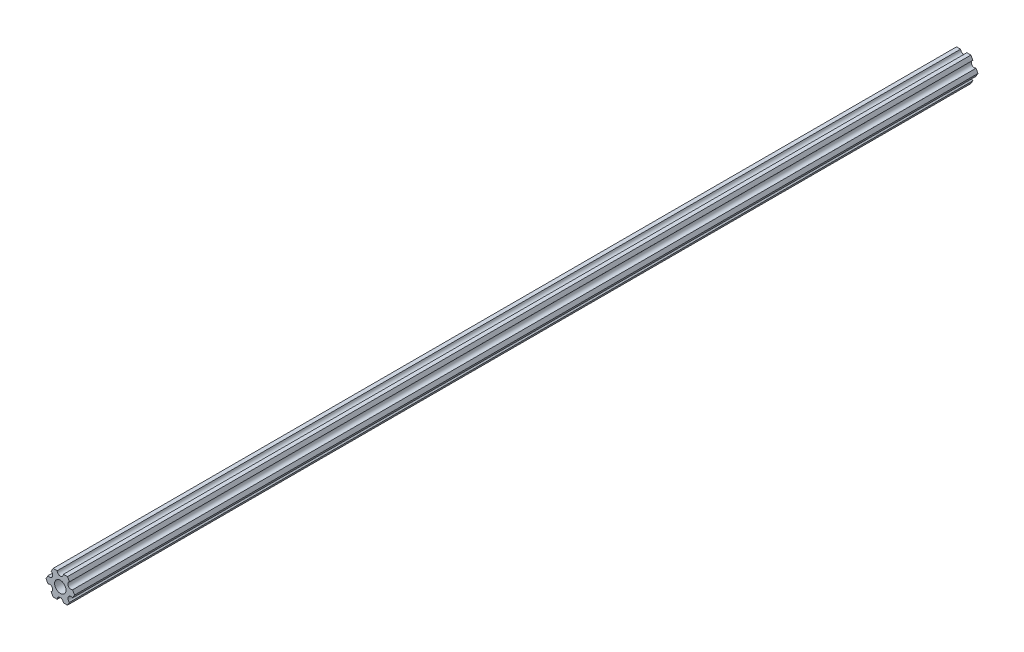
ISO-10303-21;
HEADER;
FILE_DESCRIPTION(('STEP AP214'),'2;1');
FILE_NAME('part.step','',(''),(''),'','','');
FILE_SCHEMA(('AUTOMOTIVE_DESIGN { 1 0 10303 214 1 1 1 1 }'));
ENDSEC;
DATA;
#1=APPLICATION_CONTEXT('core data for automotive mechanical design processes');
#2=APPLICATION_PROTOCOL_DEFINITION('international standard','automotive_design',2000,#1);
#3=PRODUCT_CONTEXT('',#1,'mechanical');
#4=PRODUCT('Part','Part','',(#3));
#5=PRODUCT_RELATED_PRODUCT_CATEGORY('part','',(#4));
#6=PRODUCT_DEFINITION_FORMATION('','',#4);
#7=PRODUCT_DEFINITION_CONTEXT('part definition',#1,'design');
#8=PRODUCT_DEFINITION('design','',#6,#7);
#9=PRODUCT_DEFINITION_SHAPE('','',#8);
#10=(LENGTH_UNIT() NAMED_UNIT(*) SI_UNIT(.MILLI.,.METRE.));
#11=(NAMED_UNIT(*) PLANE_ANGLE_UNIT() SI_UNIT($,.RADIAN.));
#12=(NAMED_UNIT(*) SI_UNIT($,.STERADIAN.) SOLID_ANGLE_UNIT());
#13=UNCERTAINTY_MEASURE_WITH_UNIT(LENGTH_MEASURE(1.E-05),#10,'distance_accuracy_value','');
#14=(GEOMETRIC_REPRESENTATION_CONTEXT(3) GLOBAL_UNCERTAINTY_ASSIGNED_CONTEXT((#13)) GLOBAL_UNIT_ASSIGNED_CONTEXT((#10,
#11,#12)) REPRESENTATION_CONTEXT('',''));
#15=CARTESIAN_POINT('',(0.,0.,0.));
#16=DIRECTION('',(0.,0.,1.));
#17=DIRECTION('',(1.,0.,0.));
#18=AXIS2_PLACEMENT_3D('',#15,#16,#17);
#19=CARTESIAN_POINT('',(3.66617459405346,-6.34999977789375,304.8));
#20=DIRECTION('',(-0.86602543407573,0.499999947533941,0.));
#21=DIRECTION('',(0.,0.,1.));
#22=AXIS2_PLACEMENT_3D('',#19,#20,#21);
#23=PLANE('',#22);
#24=DIRECTION('',(0.499999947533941,0.86602543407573,0.));
#25=VECTOR('',#24,1.);
#26=CARTESIAN_POINT('',(3.66617459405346,-6.34999977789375,0.));
#27=LINE('',#26,#25);
#28=CARTESIAN_POINT('',(3.66617459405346,-6.34999977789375,0.));
#29=VERTEX_POINT('',#28);
#30=CARTESIAN_POINT('',(4.70551158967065,-4.54981504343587,0.));
#31=VERTEX_POINT('',#30);
#32=EDGE_CURVE('E324',#29,#31,#27,.T.);
#33=ORIENTED_EDGE('',*,*,#32,.T.);
#34=DIRECTION('',(0.,0.,-1.));
#35=VECTOR('',#34,1.);
#36=CARTESIAN_POINT('',(4.70551158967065,-4.54981504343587,304.8));
#37=LINE('',#36,#35);
#38=CARTESIAN_POINT('',(4.70551158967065,-4.54981504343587,463.55));
#39=VERTEX_POINT('',#38);
#40=EDGE_CURVE('E12',#39,#31,#37,.T.);
#41=ORIENTED_EDGE('',*,*,#40,.F.);
#42=DIRECTION('',(0.499999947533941,0.86602543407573,0.));
#43=VECTOR('',#42,1.);
#44=CARTESIAN_POINT('',(3.66617459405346,-6.34999977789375,463.55));
#45=LINE('',#44,#43);
#46=CARTESIAN_POINT('',(3.66617459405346,-6.34999977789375,463.55));
#47=VERTEX_POINT('',#46);
#48=EDGE_CURVE('E322',#47,#39,#45,.T.);
#49=ORIENTED_EDGE('',*,*,#48,.F.);
#50=DIRECTION('',(0.,0.,-1.));
#51=VECTOR('',#50,1.);
#52=CARTESIAN_POINT('',(3.66617459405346,-6.34999977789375,304.8));
#53=LINE('',#52,#51);
#54=EDGE_CURVE('E113',#47,#29,#53,.T.);
#55=ORIENTED_EDGE('',*,*,#54,.T.);
#56=EDGE_LOOP('',(#33,#41,#49,#55));
#57=FACE_BOUND('',#56,.T.);
#58=ADVANCED_FACE('F102',(#57),#23,.F.);
#59=CARTESIAN_POINT('',(1.58750038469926,-6.34999990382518,304.8));
#60=DIRECTION('',(-6.05825721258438E-08,1.,0.));
#61=DIRECTION('',(0.,0.,1.));
#62=AXIS2_PLACEMENT_3D('',#59,#60,#61);
#63=PLANE('',#62);
#64=DIRECTION('',(1.,6.05825721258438E-08,0.));
#65=VECTOR('',#64,1.);
#66=CARTESIAN_POINT('',(1.58750038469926,-6.34999990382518,0.));
#67=LINE('',#66,#65);
#68=CARTESIAN_POINT('',(1.58750038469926,-6.34999990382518,0.));
#69=VERTEX_POINT('',#68);
#70=EDGE_CURVE('E387',#69,#29,#67,.T.);
#71=ORIENTED_EDGE('',*,*,#70,.T.);
#72=ORIENTED_EDGE('',*,*,#54,.F.);
#73=DIRECTION('',(0.999999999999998,6.05825721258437E-08,0.));
#74=VECTOR('',#73,1.);
#75=CARTESIAN_POINT('',(1.58750038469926,-6.34999990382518,463.55));
#76=LINE('',#75,#74);
#77=CARTESIAN_POINT('',(1.58750038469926,-6.34999990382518,463.55));
#78=VERTEX_POINT('',#77);
#79=EDGE_CURVE('E339',#78,#47,#76,.T.);
#80=ORIENTED_EDGE('',*,*,#79,.F.);
#81=DIRECTION('',(0.,0.,-1.));
#82=VECTOR('',#81,1.);
#83=CARTESIAN_POINT('',(1.58750038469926,-6.34999990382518,304.8));
#84=LINE('',#83,#82);
#85=EDGE_CURVE('E410',#78,#69,#84,.T.);
#86=ORIENTED_EDGE('',*,*,#85,.T.);
#87=EDGE_LOOP('',(#71,#72,#80,#86));
#88=FACE_BOUND('',#87,.T.);
#89=ADVANCED_FACE('F550',(#88),#63,.F.);
#90=CARTESIAN_POINT('',(3.8469926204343E-07,-6.35,304.8));
#91=DIRECTION('',(0.,0.,-1.));
#92=DIRECTION('',(-1.,0.,0.));
#93=AXIS2_PLACEMENT_3D('',#90,#91,#92);
#94=CYLINDRICAL_SURFACE('',#93,1.5875);
#95=CARTESIAN_POINT('',(3.8469926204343E-07,-6.35,0.));
#96=DIRECTION('',(0.,0.,-1.));
#97=DIRECTION('',(1.,0.,0.));
#98=AXIS2_PLACEMENT_3D('',#95,#96,#97);
#99=CIRCLE('',#98,1.5875);
#100=CARTESIAN_POINT('',(-1.58749961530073,-6.35000009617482,0.));
#101=VERTEX_POINT('',#100);
#102=EDGE_CURVE('E391',#101,#69,#99,.T.);
#103=ORIENTED_EDGE('',*,*,#102,.T.);
#104=ORIENTED_EDGE('',*,*,#85,.F.);
#105=CARTESIAN_POINT('',(3.8469926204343E-07,-6.35,463.55));
#106=DIRECTION('',(0.,0.,1.));
#107=DIRECTION('',(1.,0.,0.));
#108=AXIS2_PLACEMENT_3D('',#105,#106,#107);
#109=CIRCLE('',#108,1.5875);
#110=CARTESIAN_POINT('',(-1.58749961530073,-6.35000009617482,463.55));
#111=VERTEX_POINT('',#110);
#112=EDGE_CURVE('E341',#78,#111,#109,.T.);
#113=ORIENTED_EDGE('',*,*,#112,.T.);
#114=DIRECTION('',(0.,0.,-1.));
#115=VECTOR('',#114,1.);
#116=CARTESIAN_POINT('',(-1.58749961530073,-6.35000009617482,304.8));
#117=LINE('',#116,#115);
#118=EDGE_CURVE('E401',#111,#101,#117,.T.);
#119=ORIENTED_EDGE('',*,*,#118,.T.);
#120=EDGE_LOOP('',(#103,#104,#113,#119));
#121=FACE_BOUND('',#120,.T.);
#122=ADVANCED_FACE('F555',(#121),#94,.F.);
#123=CARTESIAN_POINT('',(-3.66617382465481,-6.35000022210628,304.8));
#124=DIRECTION('',(-6.05825854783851E-08,1.,0.));
#125=DIRECTION('',(0.,0.,1.));
#126=AXIS2_PLACEMENT_3D('',#123,#124,#125);
#127=PLANE('',#126);
#128=DIRECTION('',(1.,6.05825854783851E-08,0.));
#129=VECTOR('',#128,1.);
#130=CARTESIAN_POINT('',(-3.66617382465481,-6.35000022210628,0.));
#131=LINE('',#130,#129);
#132=CARTESIAN_POINT('',(-3.66617382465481,-6.35000022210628,0.));
#133=VERTEX_POINT('',#132);
#134=EDGE_CURVE('E469',#133,#101,#131,.T.);
#135=ORIENTED_EDGE('',*,*,#134,.T.);
#136=ORIENTED_EDGE('',*,*,#118,.F.);
#137=DIRECTION('',(0.999999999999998,6.05825863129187E-08,0.));
#138=VECTOR('',#137,1.);
#139=CARTESIAN_POINT('',(-3.66617382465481,-6.35000022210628,463.55));
#140=LINE('',#139,#138);
#141=CARTESIAN_POINT('',(-3.66617382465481,-6.35000022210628,463.55));
#142=VERTEX_POINT('',#141);
#143=EDGE_CURVE('E347',#142,#111,#140,.T.);
#144=ORIENTED_EDGE('',*,*,#143,.F.);
#145=DIRECTION('',(0.,0.,-1.));
#146=VECTOR('',#145,1.);
#147=CARTESIAN_POINT('',(-3.66617382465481,-6.35000022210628,304.8));
#148=LINE('',#147,#146);
#149=EDGE_CURVE('E398',#142,#133,#148,.T.);
#150=ORIENTED_EDGE('',*,*,#149,.T.);
#151=EDGE_LOOP('',(#135,#136,#144,#150));
#152=FACE_BOUND('',#151,.T.);
#153=ADVANCED_FACE('F596',(#152),#127,.F.);
#154=CARTESIAN_POINT('',(-4.70551103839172,-4.54981561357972,304.8));
#155=DIRECTION('',(0.866025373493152,0.500000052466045,0.));
#156=DIRECTION('',(0.,0.,-1.));
#157=AXIS2_PLACEMENT_3D('',#154,#155,#156);
#158=PLANE('',#157);
#159=DIRECTION('',(0.500000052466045,-0.866025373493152,0.));
#160=VECTOR('',#159,1.);
#161=CARTESIAN_POINT('',(-4.70551103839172,-4.54981561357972,0.));
#162=LINE('',#161,#160);
#163=CARTESIAN_POINT('',(-4.70551103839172,-4.54981561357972,0.));
#164=VERTEX_POINT('',#163);
#165=EDGE_CURVE('E444',#164,#133,#162,.T.);
#166=ORIENTED_EDGE('',*,*,#165,.T.);
#167=ORIENTED_EDGE('',*,*,#149,.F.);
#168=DIRECTION('',(0.500000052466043,-0.866025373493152,0.));
#169=VECTOR('',#168,1.);
#170=CARTESIAN_POINT('',(-4.70551103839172,-4.54981561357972,463.55));
#171=LINE('',#170,#169);
#172=CARTESIAN_POINT('',(-4.70551103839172,-4.54981561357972,463.55));
#173=VERTEX_POINT('',#172);
#174=EDGE_CURVE('E350',#173,#142,#171,.T.);
#175=ORIENTED_EDGE('',*,*,#174,.F.);
#176=DIRECTION('',(0.,0.,-1.));
#177=VECTOR('',#176,1.);
#178=CARTESIAN_POINT('',(-4.70551103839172,-4.54981561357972,304.8));
#179=LINE('',#178,#177);
#180=EDGE_CURVE('E402',#173,#164,#179,.T.);
#181=ORIENTED_EDGE('',*,*,#180,.T.);
#182=EDGE_LOOP('',(#166,#167,#175,#181));
#183=FACE_BOUND('',#182,.T.);
#184=ADVANCED_FACE('F601',(#183),#158,.F.);
#185=CARTESIAN_POINT('',(-5.49926112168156,-3.17500033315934,304.8));
#186=DIRECTION('',(0.,0.,-1.));
#187=DIRECTION('',(-1.,0.,0.));
#188=AXIS2_PLACEMENT_3D('',#185,#186,#187);
#189=CYLINDRICAL_SURFACE('',#188,1.5875);
#190=CARTESIAN_POINT('',(-5.49926112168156,-3.17500033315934,0.));
#191=DIRECTION('',(0.,0.,-1.));
#192=DIRECTION('',(1.,0.,0.));
#193=AXIS2_PLACEMENT_3D('',#190,#191,#192);
#194=CIRCLE('',#193,1.5875);
#195=CARTESIAN_POINT('',(-6.29301120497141,-1.80018505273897,0.));
#196=VERTEX_POINT('',#195);
#197=EDGE_CURVE('E441',#196,#164,#194,.T.);
#198=ORIENTED_EDGE('',*,*,#197,.T.);
#199=ORIENTED_EDGE('',*,*,#180,.F.);
#200=CARTESIAN_POINT('',(-5.49926112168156,-3.17500033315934,463.55));
#201=DIRECTION('',(0.,0.,1.));
#202=DIRECTION('',(1.,0.,0.));
#203=AXIS2_PLACEMENT_3D('',#200,#201,#202);
#204=CIRCLE('',#203,1.5875);
#205=CARTESIAN_POINT('',(-6.29301120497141,-1.80018505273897,463.55));
#206=VERTEX_POINT('',#205);
#207=EDGE_CURVE('E353',#173,#206,#204,.T.);
#208=ORIENTED_EDGE('',*,*,#207,.T.);
#209=DIRECTION('',(0.,0.,-1.));
#210=VECTOR('',#209,1.);
#211=CARTESIAN_POINT('',(-6.29301120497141,-1.80018505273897,304.8));
#212=LINE('',#211,#210);
#213=EDGE_CURVE('E216',#206,#196,#212,.T.);
#214=ORIENTED_EDGE('',*,*,#213,.T.);
#215=EDGE_LOOP('',(#198,#199,#208,#214));
#216=FACE_BOUND('',#215,.T.);
#217=ADVANCED_FACE('F604',(#216),#189,.F.);
#218=CARTESIAN_POINT('',(-7.33234841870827,-4.44212523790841E-07,304.8));
#219=DIRECTION('',(0.866025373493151,0.500000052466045,0.));
#220=DIRECTION('',(0.,0.,-1.));
#221=AXIS2_PLACEMENT_3D('',#218,#219,#220);
#222=PLANE('',#221);
#223=DIRECTION('',(0.500000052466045,-0.866025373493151,0.));
#224=VECTOR('',#223,1.);
#225=CARTESIAN_POINT('',(-7.33234841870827,-4.44212523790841E-07,0.));
#226=LINE('',#225,#224);
#227=CARTESIAN_POINT('',(-7.33234841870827,-4.44212523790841E-07,0.));
#228=VERTEX_POINT('',#227);
#229=EDGE_CURVE('E407',#228,#196,#226,.T.);
#230=ORIENTED_EDGE('',*,*,#229,.T.);
#231=ORIENTED_EDGE('',*,*,#213,.F.);
#232=DIRECTION('',(0.500000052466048,-0.866025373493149,0.));
#233=VECTOR('',#232,1.);
#234=CARTESIAN_POINT('',(-7.33234841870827,-4.44212523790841E-07,463.55));
#235=LINE('',#234,#233);
#236=CARTESIAN_POINT('',(-7.33234841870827,-4.44212523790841E-07,463.55));
#237=VERTEX_POINT('',#236);
#238=EDGE_CURVE('E355',#237,#206,#235,.T.);
#239=ORIENTED_EDGE('',*,*,#238,.F.);
#240=DIRECTION('',(0.,0.,-1.));
#241=VECTOR('',#240,1.);
#242=CARTESIAN_POINT('',(-7.33234841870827,-4.44212523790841E-07,304.8));
#243=LINE('',#242,#241);
#244=EDGE_CURVE('E202',#237,#228,#243,.T.);
#245=ORIENTED_EDGE('',*,*,#244,.T.);
#246=EDGE_LOOP('',(#230,#231,#239,#245));
#247=FACE_BOUND('',#246,.T.);
#248=ADVANCED_FACE('F606',(#247),#222,.F.);
#249=CARTESIAN_POINT('',(-6.29301142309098,1.80018429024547,304.8));
#250=DIRECTION('',(0.866025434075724,-0.499999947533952,0.));
#251=DIRECTION('',(0.,0.,-1.));
#252=AXIS2_PLACEMENT_3D('',#249,#250,#251);
#253=PLANE('',#252);
#254=DIRECTION('',(-0.499999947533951,-0.866025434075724,0.));
#255=VECTOR('',#254,1.);
#256=CARTESIAN_POINT('',(-6.29301142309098,1.80018429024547,0.));
#257=LINE('',#256,#255);
#258=CARTESIAN_POINT('',(-6.29301142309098,1.80018429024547,0.));
#259=VERTEX_POINT('',#258);
#260=EDGE_CURVE('E403',#259,#228,#257,.T.);
#261=ORIENTED_EDGE('',*,*,#260,.T.);
#262=ORIENTED_EDGE('',*,*,#244,.F.);
#263=DIRECTION('',(-0.499999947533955,-0.866025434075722,0.));
#264=VECTOR('',#263,1.);
#265=CARTESIAN_POINT('',(-6.29301142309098,1.80018429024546,463.55));
#266=LINE('',#265,#264);
#267=CARTESIAN_POINT('',(-6.29301142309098,1.80018429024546,463.55));
#268=VERTEX_POINT('',#267);
#269=EDGE_CURVE('E358',#268,#237,#266,.T.);
#270=ORIENTED_EDGE('',*,*,#269,.F.);
#271=DIRECTION('',(0.,0.,-1.));
#272=VECTOR('',#271,1.);
#273=CARTESIAN_POINT('',(-6.29301142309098,1.80018429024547,304.8));
#274=LINE('',#273,#272);
#275=EDGE_CURVE('E397',#268,#259,#274,.T.);
#276=ORIENTED_EDGE('',*,*,#275,.T.);
#277=EDGE_LOOP('',(#261,#262,#270,#276));
#278=FACE_BOUND('',#277,.T.);
#279=ADVANCED_FACE('F611',(#278),#253,.F.);
#280=CARTESIAN_POINT('',(-5.49926150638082,3.17499966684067,304.8));
#281=DIRECTION('',(0.,0.,-1.));
#282=DIRECTION('',(-1.,0.,0.));
#283=AXIS2_PLACEMENT_3D('',#280,#281,#282);
#284=CYLINDRICAL_SURFACE('',#283,1.5875);
#285=CARTESIAN_POINT('',(-5.49926150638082,3.17499966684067,0.));
#286=DIRECTION('',(0.,0.,-1.));
#287=DIRECTION('',(1.,0.,0.));
#288=AXIS2_PLACEMENT_3D('',#285,#286,#287);
#289=CIRCLE('',#288,1.5875);
#290=CARTESIAN_POINT('',(-4.70551158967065,4.54981504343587,0.));
#291=VERTEX_POINT('',#290);
#292=EDGE_CURVE('E406',#291,#259,#289,.T.);
#293=ORIENTED_EDGE('',*,*,#292,.T.);
#294=ORIENTED_EDGE('',*,*,#275,.F.);
#295=CARTESIAN_POINT('',(-5.49926150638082,3.17499966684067,463.55));
#296=DIRECTION('',(0.,0.,1.));
#297=DIRECTION('',(1.,0.,0.));
#298=AXIS2_PLACEMENT_3D('',#295,#296,#297);
#299=CIRCLE('',#298,1.5875);
#300=CARTESIAN_POINT('',(-4.70551158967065,4.54981504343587,463.55));
#301=VERTEX_POINT('',#300);
#302=EDGE_CURVE('E361',#268,#301,#299,.T.);
#303=ORIENTED_EDGE('',*,*,#302,.T.);
#304=DIRECTION('',(0.,0.,-1.));
#305=VECTOR('',#304,1.);
#306=CARTESIAN_POINT('',(-4.70551158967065,4.54981504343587,304.8));
#307=LINE('',#306,#305);
#308=EDGE_CURVE('E424',#301,#291,#307,.T.);
#309=ORIENTED_EDGE('',*,*,#308,.T.);
#310=EDGE_LOOP('',(#293,#294,#303,#309));
#311=FACE_BOUND('',#310,.T.);
#312=ADVANCED_FACE('F104',(#311),#284,.F.);
#313=CARTESIAN_POINT('',(-3.66617459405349,6.3499997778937,304.8));
#314=DIRECTION('',(0.866025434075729,-0.499999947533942,0.));
#315=DIRECTION('',(0.,0.,-1.));
#316=AXIS2_PLACEMENT_3D('',#313,#314,#315);
#317=PLANE('',#316);
#318=DIRECTION('',(-0.499999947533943,-0.866025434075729,0.));
#319=VECTOR('',#318,1.);
#320=CARTESIAN_POINT('',(-3.66617459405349,6.3499997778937,0.));
#321=LINE('',#320,#319);
#322=CARTESIAN_POINT('',(-3.66617459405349,6.3499997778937,0.));
#323=VERTEX_POINT('',#322);
#324=EDGE_CURVE('E416',#323,#291,#321,.T.);
#325=ORIENTED_EDGE('',*,*,#324,.T.);
#326=ORIENTED_EDGE('',*,*,#308,.F.);
#327=DIRECTION('',(-0.499999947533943,-0.866025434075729,0.));
#328=VECTOR('',#327,1.);
#329=CARTESIAN_POINT('',(-3.66617459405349,6.3499997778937,463.55));
#330=LINE('',#329,#328);
#331=CARTESIAN_POINT('',(-3.66617459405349,6.3499997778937,463.55));
#332=VERTEX_POINT('',#331);
#333=EDGE_CURVE('E364',#332,#301,#330,.T.);
#334=ORIENTED_EDGE('',*,*,#333,.F.);
#335=DIRECTION('',(0.,0.,-1.));
#336=VECTOR('',#335,1.);
#337=CARTESIAN_POINT('',(-3.66617459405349,6.3499997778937,304.8));
#338=LINE('',#337,#336);
#339=EDGE_CURVE('E427',#332,#323,#338,.T.);
#340=ORIENTED_EDGE('',*,*,#339,.T.);
#341=EDGE_LOOP('',(#325,#326,#334,#340));
#342=FACE_BOUND('',#341,.T.);
#343=ADVANCED_FACE('F577',(#342),#317,.F.);
#344=CARTESIAN_POINT('',(-1.58750038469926,6.34999990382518,304.8));
#345=DIRECTION('',(6.05825963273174E-08,-1.,0.));
#346=DIRECTION('',(0.,0.,-1.));
#347=AXIS2_PLACEMENT_3D('',#344,#345,#346);
#348=PLANE('',#347);
#349=DIRECTION('',(-1.,-6.05825963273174E-08,0.));
#350=VECTOR('',#349,1.);
#351=CARTESIAN_POINT('',(-1.58750038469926,6.34999990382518,0.));
#352=LINE('',#351,#350);
#353=CARTESIAN_POINT('',(-1.58750038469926,6.34999990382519,0.));
#354=VERTEX_POINT('',#353);
#355=EDGE_CURVE('E420',#354,#323,#352,.T.);
#356=ORIENTED_EDGE('',*,*,#355,.T.);
#357=ORIENTED_EDGE('',*,*,#339,.F.);
#358=DIRECTION('',(-0.999999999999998,-6.05826013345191E-08,0.));
#359=VECTOR('',#358,1.);
#360=CARTESIAN_POINT('',(-1.58750038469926,6.34999990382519,463.55));
#361=LINE('',#360,#359);
#362=CARTESIAN_POINT('',(-1.58750038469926,6.34999990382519,463.55));
#363=VERTEX_POINT('',#362);
#364=EDGE_CURVE('E367',#363,#332,#361,.T.);
#365=ORIENTED_EDGE('',*,*,#364,.F.);
#366=DIRECTION('',(0.,0.,-1.));
#367=VECTOR('',#366,1.);
#368=CARTESIAN_POINT('',(-1.58750038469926,6.34999990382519,304.8));
#369=LINE('',#368,#367);
#370=EDGE_CURVE('E447',#363,#354,#369,.T.);
#371=ORIENTED_EDGE('',*,*,#370,.T.);
#372=EDGE_LOOP('',(#356,#357,#365,#371));
#373=FACE_BOUND('',#372,.T.);
#374=ADVANCED_FACE('F560',(#373),#348,.F.);
#375=CARTESIAN_POINT('',(-3.84699260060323E-07,6.35,304.8));
#376=DIRECTION('',(0.,0.,-1.));
#377=DIRECTION('',(-1.,0.,0.));
#378=AXIS2_PLACEMENT_3D('',#375,#376,#377);
#379=CYLINDRICAL_SURFACE('',#378,1.5875);
#380=CARTESIAN_POINT('',(-3.84699260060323E-07,6.35,0.));
#381=DIRECTION('',(0.,0.,-1.));
#382=DIRECTION('',(1.,0.,0.));
#383=AXIS2_PLACEMENT_3D('',#380,#381,#382);
#384=CIRCLE('',#383,1.5875);
#385=CARTESIAN_POINT('',(1.58749961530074,6.35000009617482,0.));
#386=VERTEX_POINT('',#385);
#387=EDGE_CURVE('E457',#386,#354,#384,.T.);
#388=ORIENTED_EDGE('',*,*,#387,.T.);
#389=ORIENTED_EDGE('',*,*,#370,.F.);
#390=CARTESIAN_POINT('',(-3.84699260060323E-07,6.35,463.55));
#391=DIRECTION('',(0.,0.,1.));
#392=DIRECTION('',(1.,0.,0.));
#393=AXIS2_PLACEMENT_3D('',#390,#391,#392);
#394=CIRCLE('',#393,1.5875);
#395=CARTESIAN_POINT('',(1.58749961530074,6.35000009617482,463.55));
#396=VERTEX_POINT('',#395);
#397=EDGE_CURVE('E370',#363,#396,#394,.T.);
#398=ORIENTED_EDGE('',*,*,#397,.T.);
#399=DIRECTION('',(0.,0.,-1.));
#400=VECTOR('',#399,1.);
#401=CARTESIAN_POINT('',(1.58749961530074,6.35000009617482,304.8));
#402=LINE('',#401,#400);
#403=EDGE_CURVE('E440',#396,#386,#402,.T.);
#404=ORIENTED_EDGE('',*,*,#403,.T.);
#405=EDGE_LOOP('',(#388,#389,#398,#404));
#406=FACE_BOUND('',#405,.T.);
#407=ADVANCED_FACE('F568',(#406),#379,.F.);
#408=CARTESIAN_POINT('',(3.66617382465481,6.35000022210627,304.8));
#409=DIRECTION('',(6.05825850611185E-08,-1.,0.));
#410=DIRECTION('',(0.,0.,-1.));
#411=AXIS2_PLACEMENT_3D('',#408,#409,#410);
#412=PLANE('',#411);
#413=DIRECTION('',(-1.,-6.05825850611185E-08,0.));
#414=VECTOR('',#413,1.);
#415=CARTESIAN_POINT('',(3.66617382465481,6.35000022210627,0.));
#416=LINE('',#415,#414);
#417=CARTESIAN_POINT('',(3.66617382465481,6.35000022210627,0.));
#418=VERTEX_POINT('',#417);
#419=EDGE_CURVE('E461',#418,#386,#416,.T.);
#420=ORIENTED_EDGE('',*,*,#419,.T.);
#421=ORIENTED_EDGE('',*,*,#403,.F.);
#422=DIRECTION('',(-0.999999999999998,-6.05825813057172E-08,0.));
#423=VECTOR('',#422,1.);
#424=CARTESIAN_POINT('',(3.66617382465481,6.35000022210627,463.55));
#425=LINE('',#424,#423);
#426=CARTESIAN_POINT('',(3.66617382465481,6.35000022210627,463.55));
#427=VERTEX_POINT('',#426);
#428=EDGE_CURVE('E373',#427,#396,#425,.T.);
#429=ORIENTED_EDGE('',*,*,#428,.F.);
#430=DIRECTION('',(0.,0.,-1.));
#431=VECTOR('',#430,1.);
#432=CARTESIAN_POINT('',(3.66617382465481,6.35000022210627,304.8));
#433=LINE('',#432,#431);
#434=EDGE_CURVE('E394',#427,#418,#433,.T.);
#435=ORIENTED_EDGE('',*,*,#434,.T.);
#436=EDGE_LOOP('',(#420,#421,#429,#435));
#437=FACE_BOUND('',#436,.T.);
#438=ADVANCED_FACE('F566',(#437),#412,.F.);
#439=CARTESIAN_POINT('',(4.70551103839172,4.54981561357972,304.8));
#440=DIRECTION('',(-0.866025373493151,-0.500000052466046,0.));
#441=DIRECTION('',(-0.500000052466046,0.866025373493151,0.));
#442=AXIS2_PLACEMENT_3D('',#439,#440,#441);
#443=PLANE('',#442);
#444=DIRECTION('',(-0.500000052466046,0.866025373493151,0.));
#445=VECTOR('',#444,1.);
#446=CARTESIAN_POINT('',(4.70551103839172,4.54981561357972,0.));
#447=LINE('',#446,#445);
#448=CARTESIAN_POINT('',(4.70551103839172,4.54981561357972,0.));
#449=VERTEX_POINT('',#448);
#450=EDGE_CURVE('E482',#449,#418,#447,.T.);
#451=ORIENTED_EDGE('',*,*,#450,.T.);
#452=ORIENTED_EDGE('',*,*,#434,.F.);
#453=DIRECTION('',(-0.500000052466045,0.866025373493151,0.));
#454=VECTOR('',#453,1.);
#455=CARTESIAN_POINT('',(4.70551103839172,4.54981561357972,463.55));
#456=LINE('',#455,#454);
#457=CARTESIAN_POINT('',(4.70551103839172,4.54981561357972,463.55));
#458=VERTEX_POINT('',#457);
#459=EDGE_CURVE('E376',#458,#427,#456,.T.);
#460=ORIENTED_EDGE('',*,*,#459,.F.);
#461=DIRECTION('',(0.,0.,-1.));
#462=VECTOR('',#461,1.);
#463=CARTESIAN_POINT('',(4.70551103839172,4.54981561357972,304.8));
#464=LINE('',#463,#462);
#465=EDGE_CURVE('E411',#458,#449,#464,.T.);
#466=ORIENTED_EDGE('',*,*,#465,.T.);
#467=EDGE_LOOP('',(#451,#452,#460,#466));
#468=FACE_BOUND('',#467,.T.);
#469=ADVANCED_FACE('F564',(#468),#443,.F.);
#470=CARTESIAN_POINT('',(7.33234841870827,4.44212519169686E-07,304.8));
#471=DIRECTION('',(-0.866025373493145,-0.500000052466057,0.));
#472=DIRECTION('',(-0.500000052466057,0.866025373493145,0.));
#473=AXIS2_PLACEMENT_3D('',#470,#471,#472);
#474=PLANE('',#473);
#475=DIRECTION('',(-0.500000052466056,0.866025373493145,0.));
#476=VECTOR('',#475,1.);
#477=CARTESIAN_POINT('',(7.33234841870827,4.44212519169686E-07,0.));
#478=LINE('',#477,#476);
#479=CARTESIAN_POINT('',(7.33234841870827,4.44212519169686E-07,0.));
#480=VERTEX_POINT('',#479);
#481=CARTESIAN_POINT('',(6.29301120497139,1.80018505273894,0.));
#482=VERTEX_POINT('',#481);
#483=EDGE_CURVE('E473',#480,#482,#478,.T.);
#484=ORIENTED_EDGE('',*,*,#483,.T.);
#485=DIRECTION('',(0.,0.,-1.));
#486=VECTOR('',#485,1.);
#487=CARTESIAN_POINT('',(6.29301120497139,1.80018505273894,304.8));
#488=LINE('',#487,#486);
#489=CARTESIAN_POINT('',(6.29301120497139,1.80018505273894,463.55));
#490=VERTEX_POINT('',#489);
#491=EDGE_CURVE('E127',#490,#482,#488,.T.);
#492=ORIENTED_EDGE('',*,*,#491,.F.);
#493=DIRECTION('',(-0.500000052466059,0.866025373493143,0.));
#494=VECTOR('',#493,1.);
#495=CARTESIAN_POINT('',(7.33234841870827,4.44212519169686E-07,463.55));
#496=LINE('',#495,#494);
#497=CARTESIAN_POINT('',(7.33234841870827,4.44212519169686E-07,463.55));
#498=VERTEX_POINT('',#497);
#499=EDGE_CURVE('E381',#498,#490,#496,.T.);
#500=ORIENTED_EDGE('',*,*,#499,.F.);
#501=DIRECTION('',(0.,0.,-1.));
#502=VECTOR('',#501,1.);
#503=CARTESIAN_POINT('',(7.33234841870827,4.44212519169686E-07,304.8));
#504=LINE('',#503,#502);
#505=EDGE_CURVE('E171',#498,#480,#504,.T.);
#506=ORIENTED_EDGE('',*,*,#505,.T.);
#507=EDGE_LOOP('',(#484,#492,#500,#506));
#508=FACE_BOUND('',#507,.T.);
#509=ADVANCED_FACE('F546',(#508),#474,.F.);
#510=CARTESIAN_POINT('',(6.29301142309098,-1.80018429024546,304.8));
#511=DIRECTION('',(-0.866025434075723,0.499999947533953,0.));
#512=DIRECTION('',(0.,0.,1.));
#513=AXIS2_PLACEMENT_3D('',#510,#511,#512);
#514=PLANE('',#513);
#515=DIRECTION('',(0.499999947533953,0.866025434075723,0.));
#516=VECTOR('',#515,1.);
#517=CARTESIAN_POINT('',(6.29301142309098,-1.80018429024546,0.));
#518=LINE('',#517,#516);
#519=CARTESIAN_POINT('',(6.29301142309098,-1.80018429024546,0.));
#520=VERTEX_POINT('',#519);
#521=EDGE_CURVE('E257',#520,#480,#518,.T.);
#522=ORIENTED_EDGE('',*,*,#521,.T.);
#523=ORIENTED_EDGE('',*,*,#505,.F.);
#524=DIRECTION('',(0.499999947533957,0.866025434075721,0.));
#525=VECTOR('',#524,1.);
#526=CARTESIAN_POINT('',(6.29301142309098,-1.80018429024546,463.55));
#527=LINE('',#526,#525);
#528=CARTESIAN_POINT('',(6.29301142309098,-1.80018429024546,463.55));
#529=VERTEX_POINT('',#528);
#530=EDGE_CURVE('E384',#529,#498,#527,.T.);
#531=ORIENTED_EDGE('',*,*,#530,.F.);
#532=DIRECTION('',(0.,0.,-1.));
#533=VECTOR('',#532,1.);
#534=CARTESIAN_POINT('',(6.29301142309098,-1.80018429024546,304.8));
#535=LINE('',#534,#533);
#536=EDGE_CURVE('E329',#529,#520,#535,.T.);
#537=ORIENTED_EDGE('',*,*,#536,.T.);
#538=EDGE_LOOP('',(#522,#523,#531,#537));
#539=FACE_BOUND('',#538,.T.);
#540=ADVANCED_FACE('F536',(#539),#514,.F.);
#541=CARTESIAN_POINT('',(5.49926112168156,3.17500033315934,0.));
#542=DIRECTION('',(0.,0.,1.));
#543=DIRECTION('',(1.,0.,0.));
#544=AXIS2_PLACEMENT_3D('',#541,#542,#543);
#545=PLANE('',#544);
#546=CARTESIAN_POINT('',(0.,0.,0.));
#547=DIRECTION('',(0.,0.,1.));
#548=DIRECTION('',(1.,0.,0.));
#549=AXIS2_PLACEMENT_3D('',#546,#547,#548);
#550=CIRCLE('',#549,2.9337);
#551=CARTESIAN_POINT('',(-2.9337,0.,0.));
#552=VERTEX_POINT('',#551);
#553=CARTESIAN_POINT('',(2.9337,0.,0.));
#554=VERTEX_POINT('',#553);
#555=EDGE_CURVE('E464',#552,#554,#550,.T.);
#556=ORIENTED_EDGE('',*,*,#555,.T.);
#557=CARTESIAN_POINT('',(0.,0.,0.));
#558=DIRECTION('',(0.,0.,1.));
#559=DIRECTION('',(1.,0.,0.));
#560=AXIS2_PLACEMENT_3D('',#557,#558,#559);
#561=CIRCLE('',#560,2.9337);
#562=EDGE_CURVE('E423',#554,#552,#561,.T.);
#563=ORIENTED_EDGE('',*,*,#562,.T.);
#564=EDGE_LOOP('',(#556,#563));
#565=FACE_BOUND('',#564,.T.);
#566=ORIENTED_EDGE('',*,*,#521,.F.);
#567=CARTESIAN_POINT('',(5.49926150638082,-3.17499966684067,0.));
#568=DIRECTION('',(0.,0.,-1.));
#569=DIRECTION('',(1.,0.,0.));
#570=AXIS2_PLACEMENT_3D('',#567,#568,#569);
#571=CIRCLE('',#570,1.5875);
#572=CARTESIAN_POINT('',(3.91176150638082,-3.17499966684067,0.));
#573=VERTEX_POINT('',#572);
#574=EDGE_CURVE('E450',#573,#520,#571,.T.);
#575=ORIENTED_EDGE('',*,*,#574,.F.);
#576=CARTESIAN_POINT('',(5.49926150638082,-3.17499966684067,0.));
#577=DIRECTION('',(0.,0.,-1.));
#578=DIRECTION('',(1.,0.,0.));
#579=AXIS2_PLACEMENT_3D('',#576,#577,#578);
#580=CIRCLE('',#579,1.5875);
#581=EDGE_CURVE('E266',#31,#573,#580,.T.);
#582=ORIENTED_EDGE('',*,*,#581,.F.);
#583=ORIENTED_EDGE('',*,*,#32,.F.);
#584=ORIENTED_EDGE('',*,*,#70,.F.);
#585=ORIENTED_EDGE('',*,*,#102,.F.);
#586=ORIENTED_EDGE('',*,*,#134,.F.);
#587=ORIENTED_EDGE('',*,*,#165,.F.);
#588=ORIENTED_EDGE('',*,*,#197,.F.);
#589=ORIENTED_EDGE('',*,*,#229,.F.);
#590=ORIENTED_EDGE('',*,*,#260,.F.);
#591=ORIENTED_EDGE('',*,*,#292,.F.);
#592=ORIENTED_EDGE('',*,*,#324,.F.);
#593=ORIENTED_EDGE('',*,*,#355,.F.);
#594=ORIENTED_EDGE('',*,*,#387,.F.);
#595=ORIENTED_EDGE('',*,*,#419,.F.);
#596=ORIENTED_EDGE('',*,*,#450,.F.);
#597=CARTESIAN_POINT('',(5.49926112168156,3.17500033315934,0.));
#598=DIRECTION('',(0.,0.,-1.));
#599=DIRECTION('',(1.,0.,0.));
#600=AXIS2_PLACEMENT_3D('',#597,#598,#599);
#601=CIRCLE('',#600,1.5875);
#602=CARTESIAN_POINT('',(3.91176112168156,3.17500033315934,0.));
#603=VERTEX_POINT('',#602);
#604=EDGE_CURVE('E415',#603,#449,#601,.T.);
#605=ORIENTED_EDGE('',*,*,#604,.F.);
#606=CARTESIAN_POINT('',(5.49926112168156,3.17500033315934,0.));
#607=DIRECTION('',(0.,0.,-1.));
#608=DIRECTION('',(1.,0.,0.));
#609=AXIS2_PLACEMENT_3D('',#606,#607,#608);
#610=CIRCLE('',#609,1.5875);
#611=EDGE_CURVE('E241',#482,#603,#610,.T.);
#612=ORIENTED_EDGE('',*,*,#611,.F.);
#613=ORIENTED_EDGE('',*,*,#483,.F.);
#614=EDGE_LOOP('',(#566,#575,#582,#583,#584,#585,#586,#587,#588,#589,#590,#591,#592,#593,#594,
#595,#596,#605,#612,#613));
#615=FACE_BOUND('',#614,.T.);
#616=ADVANCED_FACE('F533',(#565,#615),#545,.F.);
#617=CARTESIAN_POINT('',(5.49926112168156,3.17500033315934,304.8));
#618=DIRECTION('',(0.,0.,-1.));
#619=DIRECTION('',(-1.,0.,0.));
#620=AXIS2_PLACEMENT_3D('',#617,#618,#619);
#621=CYLINDRICAL_SURFACE('',#620,1.5875);
#622=ORIENTED_EDGE('',*,*,#465,.F.);
#623=CARTESIAN_POINT('',(5.49926112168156,3.17500033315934,463.55));
#624=DIRECTION('',(0.,0.,1.));
#625=DIRECTION('',(1.,0.,0.));
#626=AXIS2_PLACEMENT_3D('',#623,#624,#625);
#627=CIRCLE('',#626,1.5875);
#628=EDGE_CURVE('E379',#458,#490,#627,.T.);
#629=ORIENTED_EDGE('',*,*,#628,.T.);
#630=ORIENTED_EDGE('',*,*,#491,.T.);
#631=ORIENTED_EDGE('',*,*,#611,.T.);
#632=DIRECTION('',(0.,0.,-1.));
#633=VECTOR('',#632,1.);
#634=CARTESIAN_POINT('',(3.91176112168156,3.17500033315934,304.8));
#635=LINE('',#634,#633);
#636=CARTESIAN_POINT('',(3.91176112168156,3.17500033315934,304.8));
#637=VERTEX_POINT('',#636);
#638=EDGE_CURVE('E247',#637,#603,#635,.T.);
#639=ORIENTED_EDGE('',*,*,#638,.F.);
#640=ORIENTED_EDGE('',*,*,#638,.T.);
#641=ORIENTED_EDGE('',*,*,#604,.T.);
#642=EDGE_LOOP('',(#622,#629,#630,#631,#639,#640,#641));
#643=FACE_BOUND('',#642,.T.);
#644=ADVANCED_FACE('F535',(#643),#621,.F.);
#645=CARTESIAN_POINT('',(5.49926150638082,-3.17499966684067,304.8));
#646=DIRECTION('',(0.,0.,-1.));
#647=DIRECTION('',(-1.,0.,0.));
#648=AXIS2_PLACEMENT_3D('',#645,#646,#647);
#649=CYLINDRICAL_SURFACE('',#648,1.5875);
#650=ORIENTED_EDGE('',*,*,#536,.F.);
#651=CARTESIAN_POINT('',(5.49926150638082,-3.17499966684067,463.55));
#652=DIRECTION('',(0.,0.,1.));
#653=DIRECTION('',(1.,0.,0.));
#654=AXIS2_PLACEMENT_3D('',#651,#652,#653);
#655=CIRCLE('',#654,1.5875);
#656=EDGE_CURVE('E326',#529,#39,#655,.T.);
#657=ORIENTED_EDGE('',*,*,#656,.T.);
#658=ORIENTED_EDGE('',*,*,#40,.T.);
#659=ORIENTED_EDGE('',*,*,#581,.T.);
#660=DIRECTION('',(0.,0.,-1.));
#661=VECTOR('',#660,1.);
#662=CARTESIAN_POINT('',(3.91176150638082,-3.17499966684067,304.8));
#663=LINE('',#662,#661);
#664=CARTESIAN_POINT('',(3.91176150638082,-3.17499966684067,304.8));
#665=VERTEX_POINT('',#664);
#666=EDGE_CURVE('E453',#665,#573,#663,.T.);
#667=ORIENTED_EDGE('',*,*,#666,.F.);
#668=ORIENTED_EDGE('',*,*,#666,.T.);
#669=ORIENTED_EDGE('',*,*,#574,.T.);
#670=EDGE_LOOP('',(#650,#657,#658,#659,#667,#668,#669));
#671=FACE_BOUND('',#670,.T.);
#672=ADVANCED_FACE('F327',(#671),#649,.F.);
#673=CARTESIAN_POINT('',(0.,0.,304.8));
#674=DIRECTION('',(0.,0.,-1.));
#675=DIRECTION('',(-1.,0.,0.));
#676=AXIS2_PLACEMENT_3D('',#673,#674,#675);
#677=CYLINDRICAL_SURFACE('',#676,2.9337);
#678=DIRECTION('',(0.,0.,-1.));
#679=VECTOR('',#678,1.);
#680=CARTESIAN_POINT('',(-2.9337,0.,304.8));
#681=LINE('',#680,#679);
#682=CARTESIAN_POINT('',(-2.9337,0.,304.8));
#683=VERTEX_POINT('',#682);
#684=EDGE_CURVE('E468',#683,#552,#681,.T.);
#685=ORIENTED_EDGE('',*,*,#684,.F.);
#686=ORIENTED_EDGE('',*,*,#684,.T.);
#687=ORIENTED_EDGE('',*,*,#562,.F.);
#688=DIRECTION('',(0.,0.,-1.));
#689=VECTOR('',#688,1.);
#690=CARTESIAN_POINT('',(2.9337,0.,304.8));
#691=LINE('',#690,#689);
#692=CARTESIAN_POINT('',(2.9337,0.,304.8));
#693=VERTEX_POINT('',#692);
#694=EDGE_CURVE('E386',#693,#554,#691,.T.);
#695=ORIENTED_EDGE('',*,*,#694,.F.);
#696=ORIENTED_EDGE('',*,*,#694,.T.);
#697=ORIENTED_EDGE('',*,*,#555,.F.);
#698=EDGE_LOOP('',(#685,#686,#687,#695,#696,#697));
#699=FACE_BOUND('',#698,.T.);
#700=CARTESIAN_POINT('',(0.,0.,463.55));
#701=DIRECTION('',(0.,0.,1.));
#702=DIRECTION('',(1.,0.,0.));
#703=AXIS2_PLACEMENT_3D('',#700,#701,#702);
#704=CIRCLE('',#703,2.9337);
#705=CARTESIAN_POINT('',(2.9337,0.,463.55));
#706=VERTEX_POINT('',#705);
#707=EDGE_CURVE('E333',#706,#706,#704,.F.);
#708=ORIENTED_EDGE('',*,*,#707,.F.);
#709=EDGE_LOOP('',(#708));
#710=FACE_BOUND('',#709,.T.);
#711=ADVANCED_FACE('F530',(#699,#710),#677,.F.);
#712=CARTESIAN_POINT('',(5.49926150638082,-3.17499966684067,463.55));
#713=DIRECTION('',(0.,0.,1.));
#714=DIRECTION('',(1.,0.,0.));
#715=AXIS2_PLACEMENT_3D('',#712,#713,#714);
#716=PLANE('',#715);
#717=ORIENTED_EDGE('',*,*,#707,.T.);
#718=EDGE_LOOP('',(#717));
#719=FACE_BOUND('',#718,.T.);
#720=ORIENTED_EDGE('',*,*,#656,.F.);
#721=ORIENTED_EDGE('',*,*,#530,.T.);
#722=ORIENTED_EDGE('',*,*,#499,.T.);
#723=ORIENTED_EDGE('',*,*,#628,.F.);
#724=ORIENTED_EDGE('',*,*,#459,.T.);
#725=ORIENTED_EDGE('',*,*,#428,.T.);
#726=ORIENTED_EDGE('',*,*,#397,.F.);
#727=ORIENTED_EDGE('',*,*,#364,.T.);
#728=ORIENTED_EDGE('',*,*,#333,.T.);
#729=ORIENTED_EDGE('',*,*,#302,.F.);
#730=ORIENTED_EDGE('',*,*,#269,.T.);
#731=ORIENTED_EDGE('',*,*,#238,.T.);
#732=ORIENTED_EDGE('',*,*,#207,.F.);
#733=ORIENTED_EDGE('',*,*,#174,.T.);
#734=ORIENTED_EDGE('',*,*,#143,.T.);
#735=ORIENTED_EDGE('',*,*,#112,.F.);
#736=ORIENTED_EDGE('',*,*,#79,.T.);
#737=ORIENTED_EDGE('',*,*,#48,.T.);
#738=EDGE_LOOP('',(#720,#721,#722,#723,#724,#725,#726,#727,#728,#729,#730,#731,#732,#733,#734,
#735,#736,#737));
#739=FACE_BOUND('',#738,.T.);
#740=ADVANCED_FACE('F336',(#719,#739),#716,.T.);
#741=CLOSED_SHELL('',(#58,#89,#122,#153,#184,#217,#248,#279,#312,#343,#374,#407,#438,#469,#509,
#540,#616,#644,#672,#711,#740));
#742=MANIFOLD_SOLID_BREP('B2',#741);
#743=ADVANCED_BREP_SHAPE_REPRESENTATION('',(#18,#742),#14);
#744=SHAPE_DEFINITION_REPRESENTATION(#9,#743);
ENDSEC;
END-ISO-10303-21;
